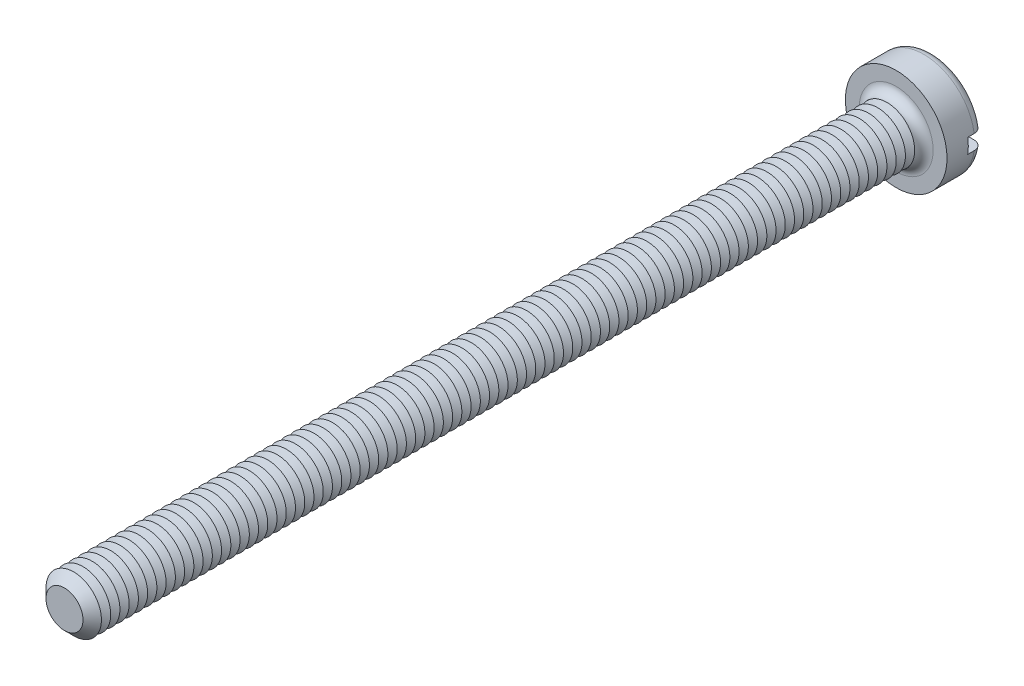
from build123d import *

# Parameters (mm, degrees)
SKETCH3_R           = 2.75
BOSS_EXTRUDE2_DEPTH = 2
SKETCH4_R           = 1.5
BOSS_EXTRUDE3_DEPTH = 45
FILLET1_R           = 0.5
CHAMFER1_SIZE       = 0.5
LPATTERN1_COUNT     = 88
LPATTERN1_PITCH     = 0.5
SKETCH8_W           = 5.5
SKETCH8_H           = 0.8
CUT_EXTRUDE1_DEPTH  = 0.85


with BuildPart() as part:
    # Sketch3 → Boss-Extrude2 (new body)
    with BuildSketch(Plane.XY):
        Circle(SKETCH3_R)
    extrude(amount=-BOSS_EXTRUDE2_DEPTH)

    # Sketch4 → Boss-Extrude3 (add)
    with BuildSketch(Plane.XY):
        with Locations(Location((0, 0, 0), (0, 0, 180))):
            Circle(SKETCH4_R)
    extrude(amount=BOSS_EXTRUDE3_DEPTH)

    # Fillet1
    fillet1_edges = [part.edges().sort_by_distance(p)[0] for p in [
        (-2.75, 0, -2),
        (1.5, 0, 0),
    ]]
    fillet(fillet1_edges, radius=FILLET1_R)

    # Chamfer1
    chamfer1_edges = [part.edges().sort_by_distance(p)[0] for p in [
        (1.5, 0, 45),
    ]]
    chamfer(chamfer1_edges, length=CHAMFER1_SIZE)

    # Sketch6 → Cut-Revolve1 (revolve, cut)
    with BuildSketch(Plane(origin=(0, 0, 0), x_dir=(0, 0, -1), z_dir=(1, 0, 0)), mode=Mode.PRIVATE) as cut_revolve1_sk:
        Polygon((-0.5, 1.5), (-0.75, 1.066987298), (-1, 1.5), align=None)
    cut_revolve1 = revolve(cut_revolve1_sk.sketch.rotate(Axis((0, 0, -1.694361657), (0, 0, 1)), 90), axis=Axis((0, 0, -1.694361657), (0, 0, 1)), mode=Mode.SUBTRACT)

    # LPattern1: Cut-Revolve1 ×88
    with Locations(*[(0, 0, i * LPATTERN1_PITCH) for i in range(1, LPATTERN1_COUNT)]):
        add(cut_revolve1, mode=Mode.SUBTRACT)

    # Sketch8 → Cut-Extrude1 (cut)
    with BuildSketch(Plane(origin=(0, 0, -2), x_dir=(-1, 0, 0), z_dir=(0, 0, -1))):
        Rectangle(SKETCH8_W, SKETCH8_H)
    extrude(amount=-CUT_EXTRUDE1_DEPTH, mode=Mode.SUBTRACT)


solid = part.part
